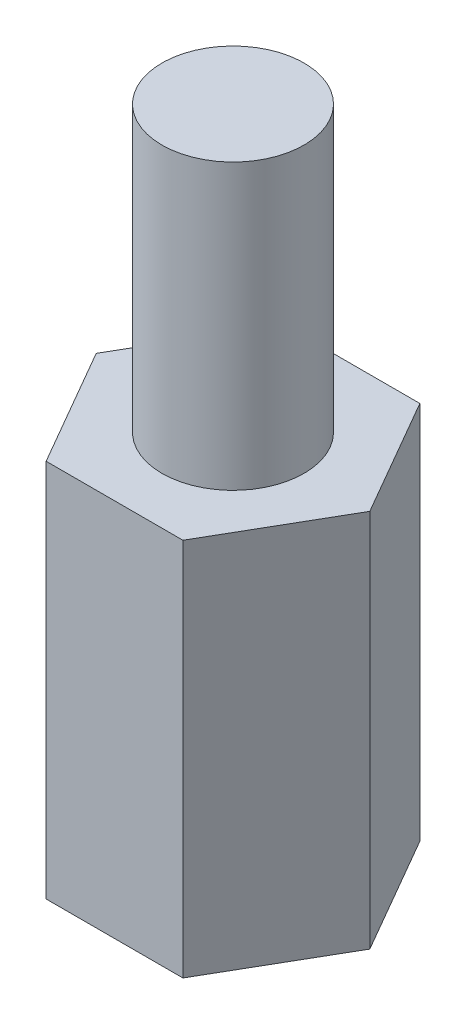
from build123d import *

# Parameters (mm, degrees)
SKETCH_1_R      = 1.5
EXTRUDE_1_DEPTH = 8
SKETCH_2_R      = 1.5
EXTRUDE_2_DEPTH = 6


with BuildPart() as part:
    # Sketch 1 → Extrude 1 (new body)
    with BuildSketch(Plane(origin=(0, 0, 0), x_dir=(1, 0, 0), z_dir=(0, 1, 0))):
        Polygon((2.886751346, 0), (1.443375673, 2.5), (-1.443375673, 2.5), (-2.886751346, 0), (-1.443375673, -2.5), (1.443375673, -2.5), align=None)
        with Locations(Location((0, 0, 0), (0, 0, 270))):
            Circle(SKETCH_1_R, mode=Mode.SUBTRACT)
    extrude(amount=EXTRUDE_1_DEPTH)


with BuildPart() as body_2:
    # Sketch 2 → Extrude 2 (new body)
    with BuildSketch(Plane(origin=(0, 8, 0), x_dir=(1, 0, 0), z_dir=(0, 1, 0))):
        with Locations(Location((0, 0, 0), (0, 0, 270))):
            Circle(SKETCH_2_R)
    extrude(amount=EXTRUDE_2_DEPTH)


solid = Compound([part.part, body_2.part])
